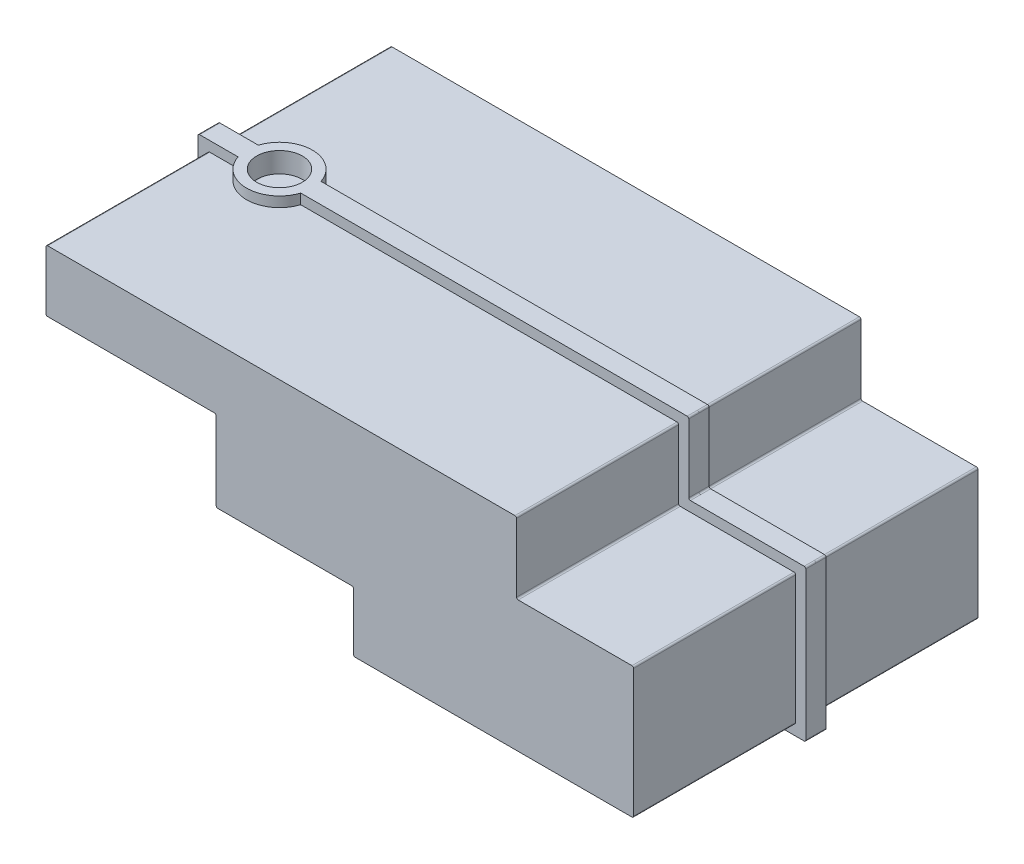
from build123d import *
from build123d.topology import SkipClean

# Parameters (mm, degrees)
SKETCH1_W            = 381
SKETCH1_H            = 139.7
BOSS_EXTRUDE1_DEPTH  = 107.95
SKETCH4_R            = 14.2875
CUT_EXTRUDE4_DEPTH   = 12.7
SKETCH5_R            = 14.2875
CUT_EXTRUDE5_DEPTH   = 12.7
CUT_EXTRUDE9_DEPTH   = 95.25
SKETCH9_W            = 73.3425
SKETCH9_H            = 44.794265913
CUT_EXTRUDE10_DEPTH  = 230.8314056
CUT_EXTRUDE11_DEPTH  = 6.35
SKETCH11_W           = 86.041230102
SKETCH11_H           = 101.6
CUT_EXTRUDE12_DEPTH  = 6.35
SKETCH12_W           = 106.681269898
SKETCH12_H           = 101.6
CUT_EXTRUDE13_DEPTH  = 6.35
SKETCH13_W           = 101.6
SKETCH13_H           = 37.755734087
CUT_EXTRUDE14_DEPTH  = 6.35
SKETCH14_W           = 101.6
SKETCH14_H           = 50.8
CUT_EXTRUDE15_DEPTH  = 6.35
SKETCH15_W           = 101.6
SKETCH15_H           = 44.794265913
CUT_EXTRUDE16_DEPTH  = 6.35
SKETCH16_W           = 101.6
SKETCH16_H           = 88.555734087
CUT_EXTRUDE17_DEPTH  = 6.35
SKETCH17_W           = 101.6
SKETCH17_H           = 44.794265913
CUT_EXTRUDE18_DEPTH  = 6.35
SKETCH18_W           = 73.3425
SKETCH18_H           = 101.6
CUT_EXTRUDE19_DEPTH  = 6.35
CUT_EXTRUDE22_DEPTH  = 6.35
FILLET1_R            = 1.016
FILLET1_OF_MIRROR1_R = 1.016


with BuildPart() as part:
    # Sketch1 → Boss-Extrude1 (new body)
    with BuildSketch(Plane.XY):
        Rectangle(SKETCH1_W, SKETCH1_H)
    boss_extrude1 = extrude(amount=BOSS_EXTRUDE1_DEPTH)

    # Sketch4 → Cut-Extrude4 (cut)
    with BuildSketch(Plane(origin=(0, 69.85, 0), x_dir=(1, 0, 0), z_dir=(0, 1, 0))):
        with Locations((-145.7325, -107.95)):
            Circle(SKETCH4_R)
    cut_extrude4 = extrude(amount=-CUT_EXTRUDE4_DEPTH, mode=Mode.SUBTRACT)

    # Sketch5 → Cut-Extrude5 (cut)
    with BuildSketch(Plane.XZ.offset(69.85)):
        with Locations((129.286, 107.95)):
            Circle(SKETCH5_R)
    cut_extrude5 = extrude(amount=-CUT_EXTRUDE5_DEPTH, mode=Mode.SUBTRACT)

    # Sketch7 → Cut-Extrude9 (cut)
    with BuildSketch(Plane.XY.offset(107.95)):
        Polygon((-173.6725, 57.150000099), (72.7075, 57.150000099), (72.7075, 44.105734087), (-10.793730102, 44.105734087), (-10.793730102, 6.005734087), (141.9225, 6.005734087), (141.9225, -6.694265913), (82.550001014, -6.694265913), (82.550001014, -44.794265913), (173.6725, -44.794265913), (173.6725, -57.494265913), (46.6725, -57.494265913), (46.6725, -44.794265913), (53.975001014, -44.794265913), (53.975001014, -6.694265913), (-49.8475, -6.694265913), (-49.8475, 6.005734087), (-39.368730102, 6.005734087), (-39.368730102, 44.105734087), (-173.6725, 44.105734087), align=None)
    cut_extrude9 = extrude(amount=-CUT_EXTRUDE9_DEPTH, mode=Mode.SUBTRACT)

    # Sketch9 → Cut-Extrude10 (cut, through all)
    with BuildSketch(Plane.XY.offset(107.95)):
        Polygon((2.2225, -69.85), (2.2225, -32.094265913), (-83.818730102, -32.094265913), (-83.818730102, 18.705734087), (-190.5, 18.705734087), (-190.5, -69.85), align=None)
        with Locations((153.82875, 47.452867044)):
            Rectangle(SKETCH9_W, SKETCH9_H)
    cut_extrude10 = extrude(amount=-CUT_EXTRUDE10_DEPTH, mode=Mode.SUBTRACT)

    # Sketch10 → Cut-Extrude11 (cut)
    with BuildSketch(Plane.XZ.offset(69.85)):
        with BuildLine():
            Line((2.2225, 101.6), (2.2225, 0))
            Line((2.2225, 0), (190.5, 0))
            Line((190.5, 0), (190.5, 101.6))
            Line((190.5, 101.6), (148.922290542, 101.6))
            ThreePointArc((148.922290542, 101.6), (129.286, 87.3125), (109.649709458, 101.6))
            Line((109.649709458, 101.6), (2.2225, 101.6))
        make_face()
    cut_extrude11 = extrude(amount=-CUT_EXTRUDE11_DEPTH, mode=Mode.SUBTRACT)

    # Sketch11 → Cut-Extrude12 (cut)
    with BuildSketch(Plane.XZ.offset(32.094265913)):
        with Locations((-40.798115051, 50.8)):
            Rectangle(SKETCH11_W, SKETCH11_H)
    cut_extrude12 = extrude(amount=-CUT_EXTRUDE12_DEPTH, mode=Mode.SUBTRACT)

    # Sketch12 → Cut-Extrude13 (cut)
    with BuildSketch(Plane.XZ.offset(-18.705734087)):
        with Locations((-137.159365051, 50.8)):
            Rectangle(SKETCH12_W, SKETCH12_H)
    cut_extrude13 = extrude(amount=-CUT_EXTRUDE13_DEPTH, mode=Mode.SUBTRACT)

    # Sketch13 → Cut-Extrude14 (cut)
    with BuildSketch(Plane.ZY.offset(-2.2225)):
        with Locations((50.8, -44.622132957)):
            Rectangle(SKETCH13_W, SKETCH13_H)
    cut_extrude14 = extrude(amount=-CUT_EXTRUDE14_DEPTH, mode=Mode.SUBTRACT)

    # Sketch14 → Cut-Extrude15 (cut)
    with BuildSketch(Plane.ZY.offset(83.818730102)):
        with Locations((50.8, -0.344265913)):
            Rectangle(SKETCH14_W, SKETCH14_H)
    cut_extrude15 = extrude(amount=-CUT_EXTRUDE15_DEPTH, mode=Mode.SUBTRACT)

    # Sketch15 → Cut-Extrude16 (cut)
    with BuildSketch(Plane.ZY.offset(190.5)):
        with Locations((50.8, 47.452867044)):
            Rectangle(SKETCH15_W, SKETCH15_H)
    cut_extrude16 = extrude(amount=-CUT_EXTRUDE16_DEPTH, mode=Mode.SUBTRACT)

    # Sketch16 → Cut-Extrude17 (cut)
    with BuildSketch(Plane(origin=(190.5, 0, 0), x_dir=(0, 0, -1), z_dir=(1, 0, 0))):
        with Locations((-50.8, -19.222132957)):
            Rectangle(SKETCH16_W, SKETCH16_H)
    cut_extrude17 = extrude(amount=-CUT_EXTRUDE17_DEPTH, mode=Mode.SUBTRACT)

    # Sketch17 → Cut-Extrude18 (cut)
    with BuildSketch(Plane(origin=(117.1575, 0, 0), x_dir=(0, 0, -1), z_dir=(1, 0, 0))):
        with Locations((-50.8, 47.452867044)):
            Rectangle(SKETCH17_W, SKETCH17_H)
    cut_extrude18 = extrude(amount=-CUT_EXTRUDE18_DEPTH, mode=Mode.SUBTRACT)

    # Sketch18 → Cut-Extrude19 (cut)
    with BuildSketch(Plane(origin=(0, 25.055734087, 0), x_dir=(1, 0, 0), z_dir=(0, 1, 0))):
        with Locations((147.47875, -50.8)):
            Rectangle(SKETCH18_W, SKETCH18_H)
    cut_extrude19 = extrude(amount=-CUT_EXTRUDE19_DEPTH, mode=Mode.SUBTRACT)

    # Sketch22 → Cut-Extrude22 (cut)
    with BuildSketch(Plane(origin=(0, 69.85, 0), x_dir=(1, 0, 0), z_dir=(0, 1, 0))):
        with BuildLine():
            Line((-184.15, -101.6), (-184.15, 0))
            Line((-184.15, 0), (110.8075, 0))
            Line((110.8075, 0), (110.8075, -101.6))
            Line((110.8075, -101.6), (-126.096209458, -101.6))
            ThreePointArc((-126.096209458, -101.6), (-145.7325, -87.3125), (-165.368790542, -101.6))
            Line((-165.368790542, -101.6), (-184.15, -101.6))
        make_face()
    cut_extrude22 = extrude(amount=-CUT_EXTRUDE22_DEPTH, mode=Mode.SUBTRACT)

    # Fillet1
    fillet1_edges = [part.edges().sort_by_distance(p)[0] for p in [
        (2.2225, -69.85, 104.775),
        (2.2225, -32.094265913, 104.775),
        (-83.818730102, -32.094265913, 104.775),
        (-83.818730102, 18.705734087, 104.775),
        (-190.5, 18.705734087, 104.775),
        (8.5725, -63.5, 50.8),
        (8.5725, -25.744265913, 50.8),
        (-77.468730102, -25.744265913, 50.8),
        (-77.468730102, 25.055734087, 50.8),
        (-184.15, 25.055734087, 50.8),
        (190.5, 25.055734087, 104.775),
        (184.15, -63.5, 50.8),
        (117.1575, 25.055734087, 104.775),
        (117.1575, 69.85, 104.775),
        (110.8075, 18.705734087, 50.8),
        (184.15, 18.705734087, 50.8),
        (-184.15, 63.5, 50.8),
        (110.8075, 63.5, 50.8),
        (-173.6725, 57.150000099, 60.325),
        (173.6725, -57.494265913, 60.325),
        (72.7075, 57.150000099, 60.325),
        (72.7075, 44.105734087, 60.325),
        (141.9225, 6.005734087, 60.325),
        (141.9225, -6.694265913, 60.325),
        (173.6725, -44.794265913, 60.325),
        (46.6725, -57.494265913, 60.325),
        (46.6725, -44.794265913, 60.325),
        (-49.8475, -6.694265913, 60.325),
        (-49.8475, 6.005734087, 60.325),
        (-173.6725, 44.105734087, 60.325),
        (190.5, -69.85, 104.775),
        (-190.5, 69.85, 104.775),
    ]]
    fillet(fillet1_edges, radius=FILLET1_R)

    # Mirror1: Boss-Extrude1, Cut-Extrude4, Cut-Extrude5, Cut-Extrude9, Cut-Extrude10, Cut-Extrude11, Cut-Extrude12, Cut-Extrude13, Cut-Extrude14, Cut-Extrude15, Cut-Extrude16, Cut-Extrude17, Cut-Extrude18, Cut-Extrude19, Cut-Extrude22 across plane
    with SkipClean():  # the faces are left unmerged after this step: merging them gives an invalid solid
        add(boss_extrude1.mirror(Plane.XY.offset(107.95)))
        add(cut_extrude4.mirror(Plane.XY.offset(107.95)), mode=Mode.SUBTRACT)
        add(cut_extrude5.mirror(Plane.XY.offset(107.95)), mode=Mode.SUBTRACT)
        add(cut_extrude9.mirror(Plane.XY.offset(107.95)), mode=Mode.SUBTRACT)
        add(cut_extrude10.mirror(Plane.XY.offset(107.95)), mode=Mode.SUBTRACT)
        add(cut_extrude11.mirror(Plane.XY.offset(107.95)), mode=Mode.SUBTRACT)
        add(cut_extrude12.mirror(Plane.XY.offset(107.95)), mode=Mode.SUBTRACT)
        add(cut_extrude13.mirror(Plane.XY.offset(107.95)), mode=Mode.SUBTRACT)
        add(cut_extrude14.mirror(Plane.XY.offset(107.95)), mode=Mode.SUBTRACT)
        add(cut_extrude15.mirror(Plane.XY.offset(107.95)), mode=Mode.SUBTRACT)
        add(cut_extrude16.mirror(Plane.XY.offset(107.95)), mode=Mode.SUBTRACT)
        add(cut_extrude17.mirror(Plane.XY.offset(107.95)), mode=Mode.SUBTRACT)
        add(cut_extrude18.mirror(Plane.XY.offset(107.95)), mode=Mode.SUBTRACT)
        add(cut_extrude19.mirror(Plane.XY.offset(107.95)), mode=Mode.SUBTRACT)
        add(cut_extrude22.mirror(Plane.XY.offset(107.95)), mode=Mode.SUBTRACT)

    # Fillet1 of Mirror1
    fillet1_of_mirror1_edges = [part.edges().sort_by_distance(p)[0] for p in [
        (2.2225, -69.85, 111.125),
        (2.2225, -32.094265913, 111.125),
        (-83.818730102, -32.094265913, 111.125),
        (-83.818730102, 18.705734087, 111.125),
        (-190.5, 18.705734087, 111.125),
        (8.5725, -63.5, 165.1),
        (8.5725, -25.744265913, 165.1),
        (-77.468730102, -25.744265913, 165.1),
        (-77.468730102, 25.055734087, 165.1),
        (-184.15, 25.055734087, 165.1),
        (190.5, 25.055734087, 111.125),
        (184.15, -63.5, 165.1),
        (117.1575, 25.055734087, 111.125),
        (117.1575, 69.85, 111.125),
        (110.8075, 18.705734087, 165.1),
        (184.15, 18.705734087, 165.1),
        (-184.15, 63.5, 165.1),
        (110.8075, 63.5, 165.1),
        (-173.6725, 57.150000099, 155.575),
        (173.6725, -57.494265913, 155.575),
        (72.7075, 57.150000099, 155.575),
        (72.7075, 44.105734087, 155.575),
        (141.9225, 6.005734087, 155.575),
        (141.9225, -6.694265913, 155.575),
        (173.6725, -44.794265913, 155.575),
        (46.6725, -57.494265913, 155.575),
        (46.6725, -44.794265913, 155.575),
        (-49.8475, -6.694265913, 155.575),
        (-49.8475, 6.005734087, 155.575),
        (-173.6725, 44.105734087, 155.575),
        (190.5, -69.85, 111.125),
        (-190.5, 69.85, 111.125),
    ]]
    fillet(fillet1_of_mirror1_edges, radius=FILLET1_OF_MIRROR1_R)


solid = part.part
